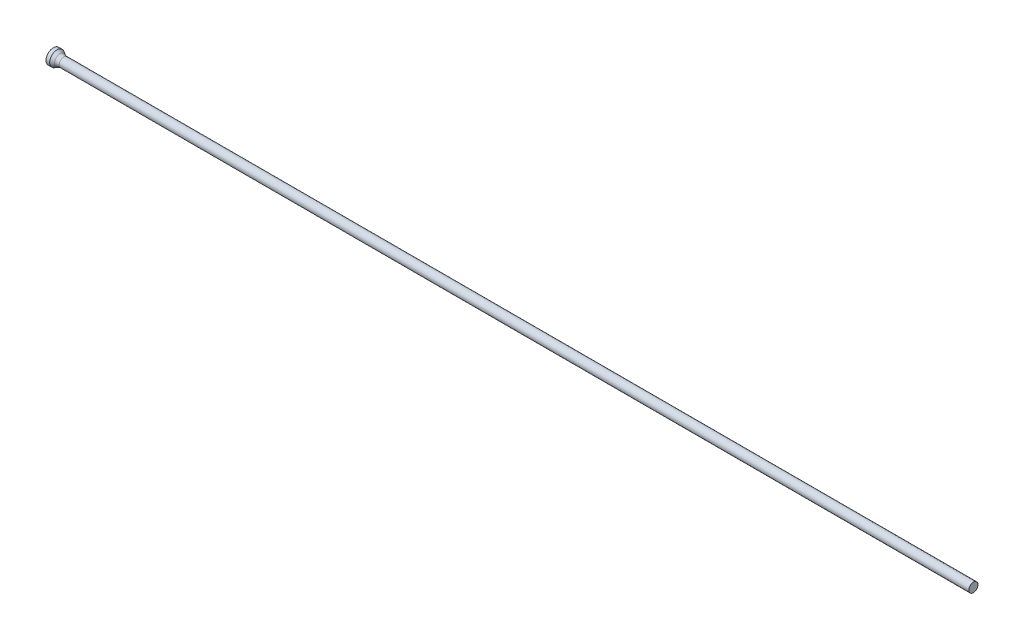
ISO-10303-21;
HEADER;
FILE_DESCRIPTION(('STEP AP214'),'2;1');
FILE_NAME('part.step','',(''),(''),'','','');
FILE_SCHEMA(('AUTOMOTIVE_DESIGN { 1 0 10303 214 1 1 1 1 }'));
ENDSEC;
DATA;
#1=APPLICATION_CONTEXT('core data for automotive mechanical design processes');
#2=APPLICATION_PROTOCOL_DEFINITION('international standard','automotive_design',2000,#1);
#3=PRODUCT_CONTEXT('',#1,'mechanical');
#4=PRODUCT('Part','Part','',(#3));
#5=PRODUCT_RELATED_PRODUCT_CATEGORY('part','',(#4));
#6=PRODUCT_DEFINITION_FORMATION('','',#4);
#7=PRODUCT_DEFINITION_CONTEXT('part definition',#1,'design');
#8=PRODUCT_DEFINITION('design','',#6,#7);
#9=PRODUCT_DEFINITION_SHAPE('','',#8);
#10=(LENGTH_UNIT() NAMED_UNIT(*) SI_UNIT(.MILLI.,.METRE.));
#11=(NAMED_UNIT(*) PLANE_ANGLE_UNIT() SI_UNIT($,.RADIAN.));
#12=(NAMED_UNIT(*) SI_UNIT($,.STERADIAN.) SOLID_ANGLE_UNIT());
#13=UNCERTAINTY_MEASURE_WITH_UNIT(LENGTH_MEASURE(1.E-05),#10,'distance_accuracy_value','');
#14=(GEOMETRIC_REPRESENTATION_CONTEXT(3) GLOBAL_UNCERTAINTY_ASSIGNED_CONTEXT((#13)) GLOBAL_UNIT_ASSIGNED_CONTEXT((#10,
#11,#12)) REPRESENTATION_CONTEXT('',''));
#15=CARTESIAN_POINT('',(0.,0.,0.));
#16=DIRECTION('',(0.,0.,1.));
#17=DIRECTION('',(1.,0.,0.));
#18=AXIS2_PLACEMENT_3D('',#15,#16,#17);
#19=CARTESIAN_POINT('',(0.,0.,0.));
#20=DIRECTION('',(1.,0.,0.));
#21=DIRECTION('',(0.,0.,-1.));
#22=AXIS2_PLACEMENT_3D('',#19,#20,#21);
#23=PLANE('',#22);
#24=CARTESIAN_POINT('',(0.,0.,0.));
#25=DIRECTION('',(-1.,0.,0.));
#26=DIRECTION('',(0.,0.,1.));
#27=AXIS2_PLACEMENT_3D('',#24,#25,#26);
#28=CIRCLE('',#27,1.);
#29=CARTESIAN_POINT('',(0.,0.,1.));
#30=VERTEX_POINT('',#29);
#31=EDGE_CURVE('E25',#30,#30,#28,.T.);
#32=ORIENTED_EDGE('',*,*,#31,.T.);
#33=EDGE_LOOP('',(#32));
#34=FACE_BOUND('',#33,.T.);
#35=ADVANCED_FACE('F14',(#34),#23,.F.);
#36=CARTESIAN_POINT('',(0.,0.,0.));
#37=DIRECTION('',(-1.,0.,0.));
#38=DIRECTION('',(0.,0.,1.));
#39=AXIS2_PLACEMENT_3D('',#36,#37,#38);
#40=CYLINDRICAL_SURFACE('',#39,1.);
#41=ORIENTED_EDGE('',*,*,#31,.F.);
#42=EDGE_LOOP('',(#41));
#43=FACE_BOUND('',#42,.T.);
#44=CARTESIAN_POINT('',(0.500480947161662,0.,0.));
#45=DIRECTION('',(-1.,0.,0.));
#46=DIRECTION('',(0.,0.,1.));
#47=AXIS2_PLACEMENT_3D('',#44,#45,#46);
#48=CIRCLE('',#47,1.);
#49=CARTESIAN_POINT('',(0.500480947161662,0.,1.));
#50=VERTEX_POINT('',#49);
#51=EDGE_CURVE('E29',#50,#50,#48,.T.);
#52=ORIENTED_EDGE('',*,*,#51,.T.);
#53=EDGE_LOOP('',(#52));
#54=FACE_BOUND('',#53,.T.);
#55=ADVANCED_FACE('F53',(#43,#54),#40,.T.);
#56=CARTESIAN_POINT('',(1.15,0.,0.));
#57=DIRECTION('',(-1.,0.,0.));
#58=DIRECTION('',(0.,0.,1.));
#59=AXIS2_PLACEMENT_3D('',#56,#57,#58);
#60=CONICAL_SURFACE('',#59,0.625,0.523598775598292);
#61=CARTESIAN_POINT('',(0.917949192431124,0.,0.));
#62=DIRECTION('',(-1.,0.,0.));
#63=DIRECTION('',(0.,0.,1.));
#64=AXIS2_PLACEMENT_3D('',#61,#62,#63);
#65=CIRCLE('',#64,0.758974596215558);
#66=CARTESIAN_POINT('',(0.917949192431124,0.,0.758974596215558));
#67=VERTEX_POINT('',#66);
#68=EDGE_CURVE('E21',#67,#67,#65,.T.);
#69=ORIENTED_EDGE('',*,*,#68,.T.);
#70=EDGE_LOOP('',(#69));
#71=FACE_BOUND('',#70,.T.);
#72=ORIENTED_EDGE('',*,*,#51,.F.);
#73=EDGE_LOOP('',(#72));
#74=FACE_BOUND('',#73,.T.);
#75=ADVANCED_FACE('F50',(#71,#74),#60,.T.);
#76=CARTESIAN_POINT('',(0.,0.,0.));
#77=DIRECTION('',(-1.,0.,0.));
#78=DIRECTION('',(0.,0.,1.));
#79=AXIS2_PLACEMENT_3D('',#76,#77,#78);
#80=CYLINDRICAL_SURFACE('',#79,0.625);
#81=CARTESIAN_POINT('',(1.41794919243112,0.,0.));
#82=DIRECTION('',(-1.,0.,0.));
#83=DIRECTION('',(0.,0.,1.));
#84=AXIS2_PLACEMENT_3D('',#81,#82,#83);
#85=CIRCLE('',#84,0.625);
#86=CARTESIAN_POINT('',(1.41794919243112,0.,0.625));
#87=VERTEX_POINT('',#86);
#88=EDGE_CURVE('E9',#87,#87,#85,.F.);
#89=ORIENTED_EDGE('',*,*,#88,.T.);
#90=EDGE_LOOP('',(#89));
#91=FACE_BOUND('',#90,.T.);
#92=CARTESIAN_POINT('',(125.,0.,0.));
#93=DIRECTION('',(-1.,0.,0.));
#94=DIRECTION('',(0.,0.,1.));
#95=AXIS2_PLACEMENT_3D('',#92,#93,#94);
#96=CIRCLE('',#95,0.625);
#97=CARTESIAN_POINT('',(125.,0.,0.625));
#98=VERTEX_POINT('',#97);
#99=EDGE_CURVE('E34',#98,#98,#96,.T.);
#100=ORIENTED_EDGE('',*,*,#99,.T.);
#101=EDGE_LOOP('',(#100));
#102=FACE_BOUND('',#101,.T.);
#103=ADVANCED_FACE('F38',(#91,#102),#80,.T.);
#104=CARTESIAN_POINT('',(125.,0.625,0.));
#105=DIRECTION('',(-1.,0.,0.));
#106=DIRECTION('',(0.,0.,1.));
#107=AXIS2_PLACEMENT_3D('',#104,#105,#106);
#108=PLANE('',#107);
#109=ORIENTED_EDGE('',*,*,#99,.F.);
#110=EDGE_LOOP('',(#109));
#111=FACE_BOUND('',#110,.T.);
#112=ADVANCED_FACE('F40',(#111),#108,.F.);
#113=CARTESIAN_POINT('',(1.41794919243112,0.,0.));
#114=DIRECTION('',(-1.,0.,0.));
#115=DIRECTION('',(0.,0.,1.));
#116=AXIS2_PLACEMENT_3D('',#113,#114,#115);
#117=TOROIDAL_SURFACE('',#116,1.625,1.);
#118=ORIENTED_EDGE('',*,*,#88,.F.);
#119=EDGE_LOOP('',(#118));
#120=FACE_BOUND('',#119,.T.);
#121=ORIENTED_EDGE('',*,*,#68,.F.);
#122=EDGE_LOOP('',(#121));
#123=FACE_BOUND('',#122,.T.);
#124=ADVANCED_FACE('F16',(#120,#123),#117,.F.);
#125=CLOSED_SHELL('',(#35,#55,#75,#103,#112,#124));
#126=MANIFOLD_SOLID_BREP('B1',#125);
#127=ADVANCED_BREP_SHAPE_REPRESENTATION('',(#18,#126),#14);
#128=SHAPE_DEFINITION_REPRESENTATION(#9,#127);
ENDSEC;
END-ISO-10303-21;
